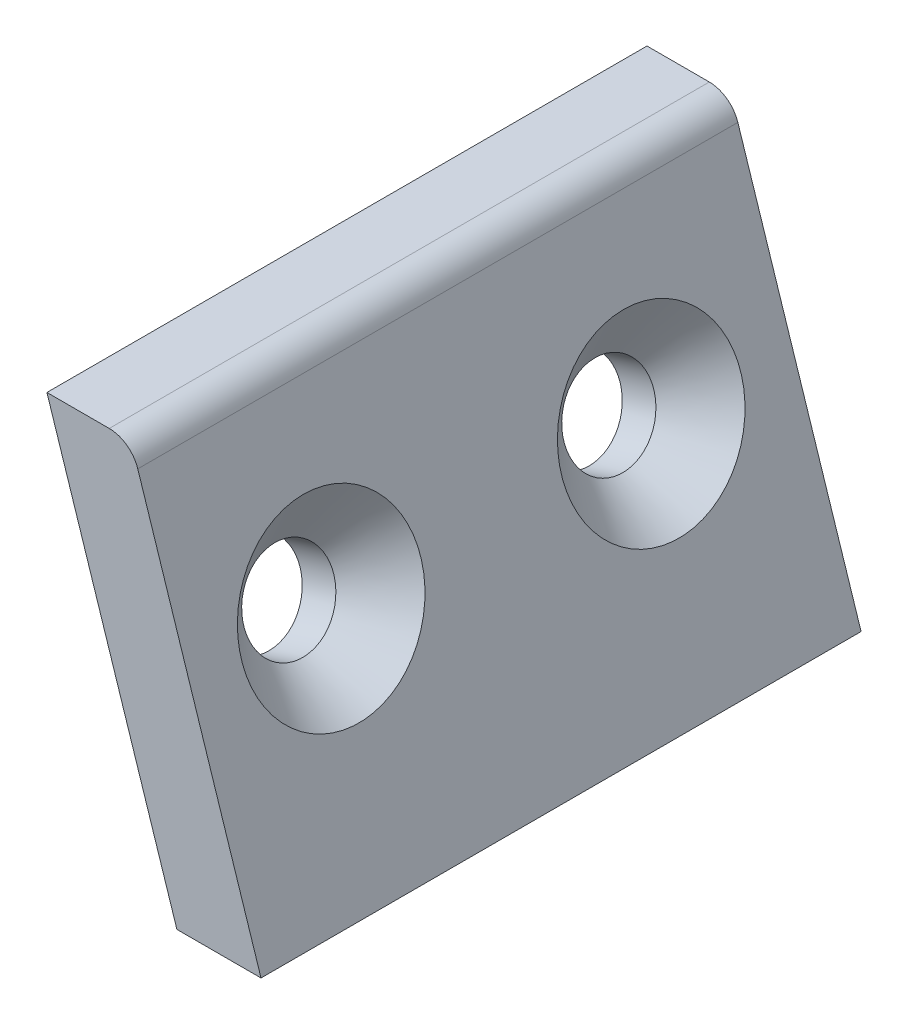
from build123d import *

# Parameters (mm, degrees)
EXTRUSION1_DEPTH                                 = 30
FRAISAGE_POUR_VIS_T_TE_FRAIS_E_6_PAN_D           = 4.5
FRAISAGE_POUR_VIS_T_TE_FRAIS_E_6_PAN_CSINK_D     = 8.96
FRAISAGE_POUR_VIS_T_TE_FRAIS_E_6_PAN_CSINK_ANGLE = 90
CONG_1_R                                         = 1.5


with BuildPart() as part:
    # Esquisse1 → Extrusion1 (new body)
    with BuildSketch(Plane.XY):
        Polygon((62.81827614, -8), (67.024125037, -8), (60.525731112, 12), (56.319882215, 12), align=None)
    extrude(amount=-EXTRUSION1_DEPTH)

    # Fraisage pour vis _ t_te frais_e _ 6 pan (through all)
    with Locations(Plane(origin=(58.272749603, 18.9339641, 0), x_dir=(0, 0, -1), z_dir=(0.9510565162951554, 0.3090169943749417, 0))):
        with Locations((23, -17.020367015), (7, -17.020367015)):
            CounterSinkHole(FRAISAGE_POUR_VIS_T_TE_FRAIS_E_6_PAN_D / 2, FRAISAGE_POUR_VIS_T_TE_FRAIS_E_6_PAN_CSINK_D / 2, counter_sink_angle=FRAISAGE_POUR_VIS_T_TE_FRAIS_E_6_PAN_CSINK_ANGLE)

    # Cong_1
    cong_1_edges = [part.edges().sort_by_distance(p)[0] for p in [
        (60.525731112, 12, -15),
    ]]
    fillet(cong_1_edges, radius=CONG_1_R)


solid = part.part
